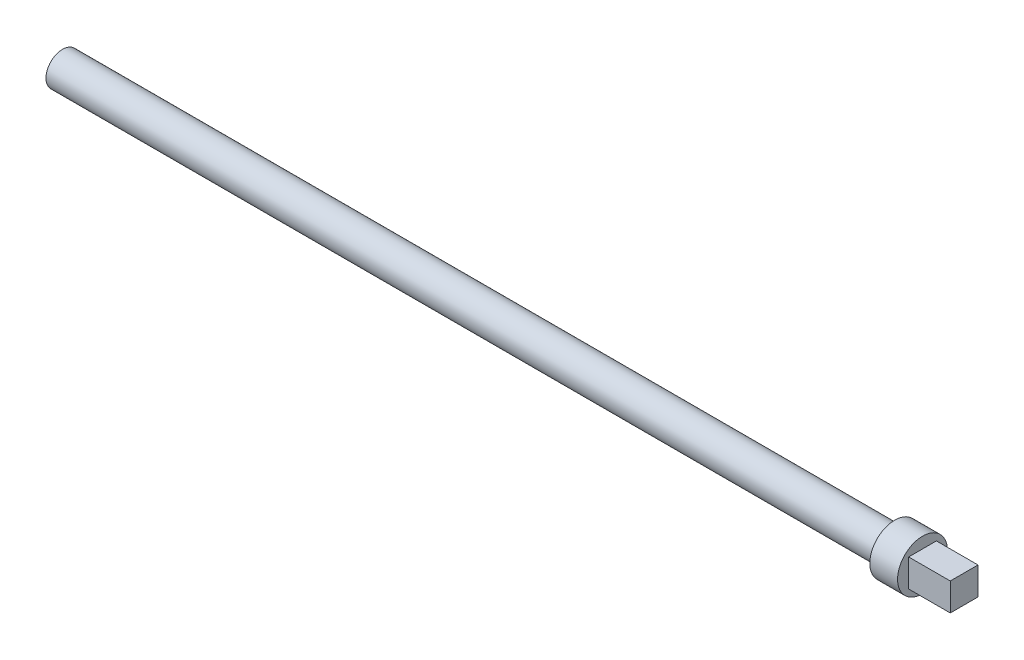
ISO-10303-21;
HEADER;
FILE_DESCRIPTION(('STEP AP214'),'2;1');
FILE_NAME('part.step','',(''),(''),'','','');
FILE_SCHEMA(('AUTOMOTIVE_DESIGN { 1 0 10303 214 1 1 1 1 }'));
ENDSEC;
DATA;
#1=APPLICATION_CONTEXT('core data for automotive mechanical design processes');
#2=APPLICATION_PROTOCOL_DEFINITION('international standard','automotive_design',2000,#1);
#3=PRODUCT_CONTEXT('',#1,'mechanical');
#4=PRODUCT('Part','Part','',(#3));
#5=PRODUCT_RELATED_PRODUCT_CATEGORY('part','',(#4));
#6=PRODUCT_DEFINITION_FORMATION('','',#4);
#7=PRODUCT_DEFINITION_CONTEXT('part definition',#1,'design');
#8=PRODUCT_DEFINITION('design','',#6,#7);
#9=PRODUCT_DEFINITION_SHAPE('','',#8);
#10=(LENGTH_UNIT() NAMED_UNIT(*) SI_UNIT(.MILLI.,.METRE.));
#11=(NAMED_UNIT(*) PLANE_ANGLE_UNIT() SI_UNIT($,.RADIAN.));
#12=(NAMED_UNIT(*) SI_UNIT($,.STERADIAN.) SOLID_ANGLE_UNIT());
#13=UNCERTAINTY_MEASURE_WITH_UNIT(LENGTH_MEASURE(1.E-05),#10,'distance_accuracy_value','');
#14=(GEOMETRIC_REPRESENTATION_CONTEXT(3) GLOBAL_UNCERTAINTY_ASSIGNED_CONTEXT((#13)) GLOBAL_UNIT_ASSIGNED_CONTEXT((#10,
#11,#12)) REPRESENTATION_CONTEXT('',''));
#15=CARTESIAN_POINT('',(0.,0.,0.));
#16=DIRECTION('',(0.,0.,1.));
#17=DIRECTION('',(1.,0.,0.));
#18=AXIS2_PLACEMENT_3D('',#15,#16,#17);
#19=CARTESIAN_POINT('',(160.,0.,0.));
#20=DIRECTION('',(1.,0.,0.));
#21=DIRECTION('',(0.,0.,-1.));
#22=AXIS2_PLACEMENT_3D('',#19,#20,#21);
#23=PLANE('',#22);
#24=CARTESIAN_POINT('',(160.,0.,0.));
#25=DIRECTION('',(1.,0.,0.));
#26=DIRECTION('',(0.,0.,-1.));
#27=AXIS2_PLACEMENT_3D('',#24,#25,#26);
#28=CIRCLE('',#27,9.);
#29=CARTESIAN_POINT('',(160.,0.,-9.));
#30=VERTEX_POINT('',#29);
#31=EDGE_CURVE('E123',#30,#30,#28,.T.);
#32=ORIENTED_EDGE('',*,*,#31,.T.);
#33=EDGE_LOOP('',(#32));
#34=FACE_BOUND('',#33,.T.);
#35=DIRECTION('',(0.,0.,1.));
#36=VECTOR('',#35,1.);
#37=CARTESIAN_POINT('',(160.,5.,5.00000000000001));
#38=LINE('',#37,#36);
#39=CARTESIAN_POINT('',(160.,5.,-4.99999999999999));
#40=VERTEX_POINT('',#39);
#41=CARTESIAN_POINT('',(160.,5.,5.00000000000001));
#42=VERTEX_POINT('',#41);
#43=EDGE_CURVE('E101',#40,#42,#38,.T.);
#44=ORIENTED_EDGE('',*,*,#43,.F.);
#45=DIRECTION('',(0.,1.,0.));
#46=VECTOR('',#45,1.);
#47=CARTESIAN_POINT('',(160.,5.,-4.99999999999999));
#48=LINE('',#47,#46);
#49=CARTESIAN_POINT('',(160.,-5.,-4.99999999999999));
#50=VERTEX_POINT('',#49);
#51=EDGE_CURVE('E112',#50,#40,#48,.T.);
#52=ORIENTED_EDGE('',*,*,#51,.F.);
#53=DIRECTION('',(0.,0.,-1.));
#54=VECTOR('',#53,1.);
#55=CARTESIAN_POINT('',(160.,-5.,5.00000000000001));
#56=LINE('',#55,#54);
#57=CARTESIAN_POINT('',(160.,-5.,5.00000000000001));
#58=VERTEX_POINT('',#57);
#59=EDGE_CURVE('E82',#58,#50,#56,.T.);
#60=ORIENTED_EDGE('',*,*,#59,.F.);
#61=DIRECTION('',(0.,-1.,0.));
#62=VECTOR('',#61,1.);
#63=CARTESIAN_POINT('',(160.,5.,5.00000000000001));
#64=LINE('',#63,#62);
#65=EDGE_CURVE('E116',#42,#58,#64,.T.);
#66=ORIENTED_EDGE('',*,*,#65,.F.);
#67=EDGE_LOOP('',(#44,#52,#60,#66));
#68=FACE_BOUND('',#67,.T.);
#69=ADVANCED_FACE('F45',(#34,#68),#23,.T.);
#70=CARTESIAN_POINT('',(150.,0.,0.));
#71=DIRECTION('',(-1.,0.,0.));
#72=DIRECTION('',(0.,0.,1.));
#73=AXIS2_PLACEMENT_3D('',#70,#71,#72);
#74=CYLINDRICAL_SURFACE('',#73,6.);
#75=CARTESIAN_POINT('',(150.,0.,0.));
#76=DIRECTION('',(1.,0.,0.));
#77=DIRECTION('',(0.,0.,-1.));
#78=AXIS2_PLACEMENT_3D('',#75,#76,#77);
#79=CIRCLE('',#78,6.);
#80=CARTESIAN_POINT('',(150.,0.,-6.));
#81=VERTEX_POINT('',#80);
#82=EDGE_CURVE('E11',#81,#81,#79,.T.);
#83=ORIENTED_EDGE('',*,*,#82,.F.);
#84=EDGE_LOOP('',(#83));
#85=FACE_BOUND('',#84,.T.);
#86=CARTESIAN_POINT('',(-150.,0.,0.));
#87=DIRECTION('',(1.,0.,0.));
#88=DIRECTION('',(0.,0.,-1.));
#89=AXIS2_PLACEMENT_3D('',#86,#87,#88);
#90=CIRCLE('',#89,6.);
#91=CARTESIAN_POINT('',(-150.,0.,-6.));
#92=VERTEX_POINT('',#91);
#93=EDGE_CURVE('E49',#92,#92,#90,.T.);
#94=ORIENTED_EDGE('',*,*,#93,.T.);
#95=EDGE_LOOP('',(#94));
#96=FACE_BOUND('',#95,.T.);
#97=ADVANCED_FACE('F47',(#85,#96),#74,.T.);
#98=CARTESIAN_POINT('',(-150.,0.,0.));
#99=DIRECTION('',(1.,0.,0.));
#100=DIRECTION('',(0.,0.,-1.));
#101=AXIS2_PLACEMENT_3D('',#98,#99,#100);
#102=PLANE('',#101);
#103=ORIENTED_EDGE('',*,*,#93,.F.);
#104=EDGE_LOOP('',(#103));
#105=FACE_BOUND('',#104,.T.);
#106=ADVANCED_FACE('F143',(#105),#102,.F.);
#107=CARTESIAN_POINT('',(160.,0.,0.));
#108=DIRECTION('',(-1.,0.,0.));
#109=DIRECTION('',(0.,0.,1.));
#110=AXIS2_PLACEMENT_3D('',#107,#108,#109);
#111=CYLINDRICAL_SURFACE('',#110,9.);
#112=ORIENTED_EDGE('',*,*,#31,.F.);
#113=EDGE_LOOP('',(#112));
#114=FACE_BOUND('',#113,.T.);
#115=CARTESIAN_POINT('',(150.,0.,0.));
#116=DIRECTION('',(1.,0.,0.));
#117=DIRECTION('',(0.,0.,-1.));
#118=AXIS2_PLACEMENT_3D('',#115,#116,#117);
#119=CIRCLE('',#118,9.);
#120=CARTESIAN_POINT('',(150.,0.,-9.));
#121=VERTEX_POINT('',#120);
#122=EDGE_CURVE('E122',#121,#121,#119,.T.);
#123=ORIENTED_EDGE('',*,*,#122,.T.);
#124=EDGE_LOOP('',(#123));
#125=FACE_BOUND('',#124,.T.);
#126=ADVANCED_FACE('F129',(#114,#125),#111,.T.);
#127=CARTESIAN_POINT('',(150.,0.,0.));
#128=DIRECTION('',(1.,0.,0.));
#129=DIRECTION('',(0.,0.,-1.));
#130=AXIS2_PLACEMENT_3D('',#127,#128,#129);
#131=PLANE('',#130);
#132=ORIENTED_EDGE('',*,*,#82,.T.);
#133=EDGE_LOOP('',(#132));
#134=FACE_BOUND('',#133,.T.);
#135=ORIENTED_EDGE('',*,*,#122,.F.);
#136=EDGE_LOOP('',(#135));
#137=FACE_BOUND('',#136,.T.);
#138=ADVANCED_FACE('F131',(#134,#137),#131,.F.);
#139=CARTESIAN_POINT('',(175.,5.,-4.99999999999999));
#140=DIRECTION('',(0.,0.,1.));
#141=DIRECTION('',(0.,-1.,0.));
#142=AXIS2_PLACEMENT_3D('',#139,#140,#141);
#143=PLANE('',#142);
#144=ORIENTED_EDGE('',*,*,#51,.T.);
#145=DIRECTION('',(-1.,0.,0.));
#146=VECTOR('',#145,1.);
#147=CARTESIAN_POINT('',(175.,5.,-4.99999999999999));
#148=LINE('',#147,#146);
#149=CARTESIAN_POINT('',(175.,5.,-4.99999999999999));
#150=VERTEX_POINT('',#149);
#151=EDGE_CURVE('E104',#150,#40,#148,.T.);
#152=ORIENTED_EDGE('',*,*,#151,.F.);
#153=DIRECTION('',(0.,1.,0.));
#154=VECTOR('',#153,1.);
#155=CARTESIAN_POINT('',(175.,5.,-4.99999999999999));
#156=LINE('',#155,#154);
#157=CARTESIAN_POINT('',(175.,-5.,-4.99999999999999));
#158=VERTEX_POINT('',#157);
#159=EDGE_CURVE('E94',#158,#150,#156,.T.);
#160=ORIENTED_EDGE('',*,*,#159,.F.);
#161=DIRECTION('',(-1.,0.,0.));
#162=VECTOR('',#161,1.);
#163=CARTESIAN_POINT('',(175.,-5.,-4.99999999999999));
#164=LINE('',#163,#162);
#165=EDGE_CURVE('E108',#158,#50,#164,.T.);
#166=ORIENTED_EDGE('',*,*,#165,.T.);
#167=EDGE_LOOP('',(#144,#152,#160,#166));
#168=FACE_BOUND('',#167,.T.);
#169=ADVANCED_FACE('F133',(#168),#143,.F.);
#170=CARTESIAN_POINT('',(175.,5.,5.00000000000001));
#171=DIRECTION('',(0.,-1.,0.));
#172=DIRECTION('',(0.,0.,-1.));
#173=AXIS2_PLACEMENT_3D('',#170,#171,#172);
#174=PLANE('',#173);
#175=ORIENTED_EDGE('',*,*,#43,.T.);
#176=DIRECTION('',(-1.,0.,0.));
#177=VECTOR('',#176,1.);
#178=CARTESIAN_POINT('',(175.,5.,5.00000000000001));
#179=LINE('',#178,#177);
#180=CARTESIAN_POINT('',(175.,5.,5.00000000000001));
#181=VERTEX_POINT('',#180);
#182=EDGE_CURVE('E98',#181,#42,#179,.T.);
#183=ORIENTED_EDGE('',*,*,#182,.F.);
#184=DIRECTION('',(0.,0.,1.));
#185=VECTOR('',#184,1.);
#186=CARTESIAN_POINT('',(175.,5.,5.00000000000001));
#187=LINE('',#186,#185);
#188=EDGE_CURVE('E89',#150,#181,#187,.T.);
#189=ORIENTED_EDGE('',*,*,#188,.F.);
#190=ORIENTED_EDGE('',*,*,#151,.T.);
#191=EDGE_LOOP('',(#175,#183,#189,#190));
#192=FACE_BOUND('',#191,.T.);
#193=ADVANCED_FACE('F99',(#192),#174,.F.);
#194=CARTESIAN_POINT('',(175.,5.,5.00000000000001));
#195=DIRECTION('',(0.,0.,-1.));
#196=DIRECTION('',(0.,1.,0.));
#197=AXIS2_PLACEMENT_3D('',#194,#195,#196);
#198=PLANE('',#197);
#199=ORIENTED_EDGE('',*,*,#65,.T.);
#200=DIRECTION('',(-1.,0.,0.));
#201=VECTOR('',#200,1.);
#202=CARTESIAN_POINT('',(175.,-5.,5.00000000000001));
#203=LINE('',#202,#201);
#204=CARTESIAN_POINT('',(175.,-5.,5.00000000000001));
#205=VERTEX_POINT('',#204);
#206=EDGE_CURVE('E60',#205,#58,#203,.T.);
#207=ORIENTED_EDGE('',*,*,#206,.F.);
#208=DIRECTION('',(0.,-1.,0.));
#209=VECTOR('',#208,1.);
#210=CARTESIAN_POINT('',(175.,5.,5.00000000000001));
#211=LINE('',#210,#209);
#212=EDGE_CURVE('E92',#181,#205,#211,.T.);
#213=ORIENTED_EDGE('',*,*,#212,.F.);
#214=ORIENTED_EDGE('',*,*,#182,.T.);
#215=EDGE_LOOP('',(#199,#207,#213,#214));
#216=FACE_BOUND('',#215,.T.);
#217=ADVANCED_FACE('F106',(#216),#198,.F.);
#218=CARTESIAN_POINT('',(175.,-5.,5.00000000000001));
#219=DIRECTION('',(0.,1.,0.));
#220=DIRECTION('',(0.,0.,1.));
#221=AXIS2_PLACEMENT_3D('',#218,#219,#220);
#222=PLANE('',#221);
#223=ORIENTED_EDGE('',*,*,#59,.T.);
#224=ORIENTED_EDGE('',*,*,#165,.F.);
#225=DIRECTION('',(0.,0.,-1.));
#226=VECTOR('',#225,1.);
#227=CARTESIAN_POINT('',(175.,-5.,5.00000000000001));
#228=LINE('',#227,#226);
#229=EDGE_CURVE('E68',#205,#158,#228,.T.);
#230=ORIENTED_EDGE('',*,*,#229,.F.);
#231=ORIENTED_EDGE('',*,*,#206,.T.);
#232=EDGE_LOOP('',(#223,#224,#230,#231));
#233=FACE_BOUND('',#232,.T.);
#234=ADVANCED_FACE('F158',(#233),#222,.F.);
#235=CARTESIAN_POINT('',(175.,0.,0.));
#236=DIRECTION('',(1.,0.,0.));
#237=DIRECTION('',(0.,0.,-1.));
#238=AXIS2_PLACEMENT_3D('',#235,#236,#237);
#239=PLANE('',#238);
#240=ORIENTED_EDGE('',*,*,#159,.T.);
#241=ORIENTED_EDGE('',*,*,#188,.T.);
#242=ORIENTED_EDGE('',*,*,#212,.T.);
#243=ORIENTED_EDGE('',*,*,#229,.T.);
#244=EDGE_LOOP('',(#240,#241,#242,#243));
#245=FACE_BOUND('',#244,.T.);
#246=ADVANCED_FACE('F90',(#245),#239,.T.);
#247=CLOSED_SHELL('',(#69,#97,#106,#126,#138,#169,#193,#217,#234,#246));
#248=MANIFOLD_SOLID_BREP('B2',#247);
#249=ADVANCED_BREP_SHAPE_REPRESENTATION('',(#18,#248),#14);
#250=SHAPE_DEFINITION_REPRESENTATION(#9,#249);
ENDSEC;
END-ISO-10303-21;
